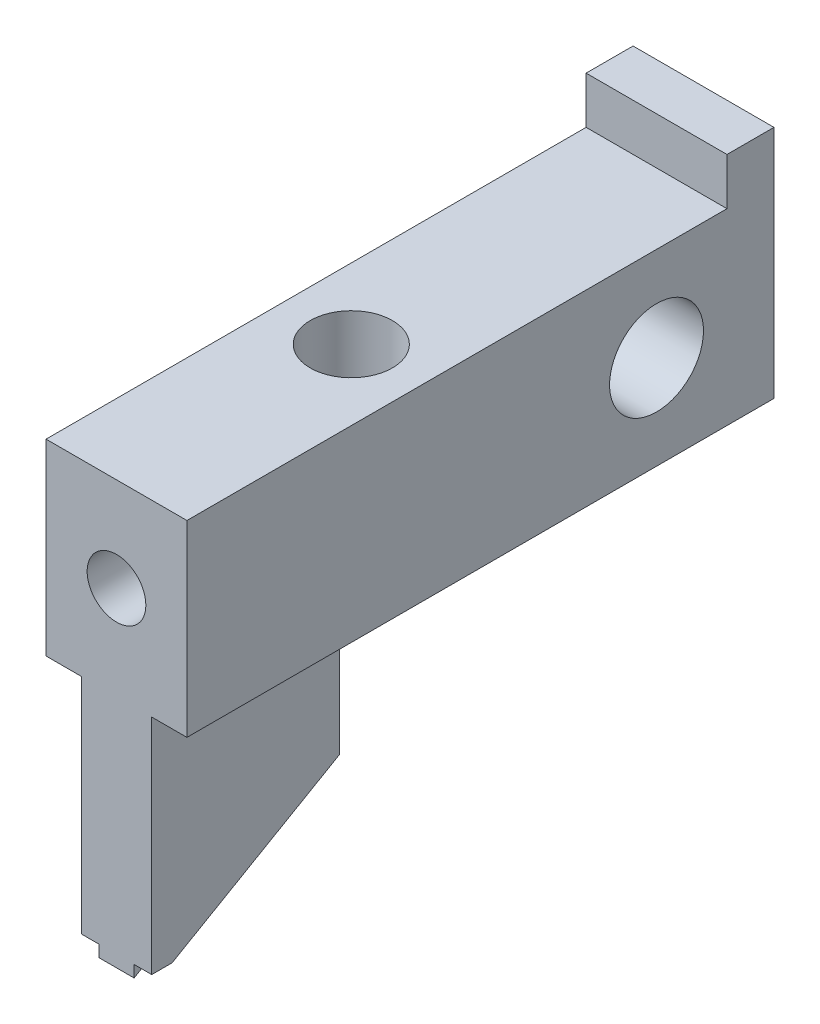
ISO-10303-21;
HEADER;
FILE_DESCRIPTION(('STEP AP214'),'2;1');
FILE_NAME('part.step','',(''),(''),'','','');
FILE_SCHEMA(('AUTOMOTIVE_DESIGN { 1 0 10303 214 1 1 1 1 }'));
ENDSEC;
DATA;
#1=APPLICATION_CONTEXT('core data for automotive mechanical design processes');
#2=APPLICATION_PROTOCOL_DEFINITION('international standard','automotive_design',2000,#1);
#3=PRODUCT_CONTEXT('',#1,'mechanical');
#4=PRODUCT('Part','Part','',(#3));
#5=PRODUCT_RELATED_PRODUCT_CATEGORY('part','',(#4));
#6=PRODUCT_DEFINITION_FORMATION('','',#4);
#7=PRODUCT_DEFINITION_CONTEXT('part definition',#1,'design');
#8=PRODUCT_DEFINITION('design','',#6,#7);
#9=PRODUCT_DEFINITION_SHAPE('','',#8);
#10=(LENGTH_UNIT() NAMED_UNIT(*) SI_UNIT(.MILLI.,.METRE.));
#11=(NAMED_UNIT(*) PLANE_ANGLE_UNIT() SI_UNIT($,.RADIAN.));
#12=(NAMED_UNIT(*) SI_UNIT($,.STERADIAN.) SOLID_ANGLE_UNIT());
#13=UNCERTAINTY_MEASURE_WITH_UNIT(LENGTH_MEASURE(1.E-05),#10,'distance_accuracy_value','');
#14=(GEOMETRIC_REPRESENTATION_CONTEXT(3) GLOBAL_UNCERTAINTY_ASSIGNED_CONTEXT((#13)) GLOBAL_UNIT_ASSIGNED_CONTEXT((#10,
#11,#12)) REPRESENTATION_CONTEXT('',''));
#15=CARTESIAN_POINT('',(0.,0.,0.));
#16=DIRECTION('',(0.,0.,1.));
#17=DIRECTION('',(1.,0.,0.));
#18=AXIS2_PLACEMENT_3D('',#15,#16,#17);
#19=CARTESIAN_POINT('',(3.,13.9999999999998,10.));
#20=DIRECTION('',(0.,0.,1.));
#21=DIRECTION('',(1.,0.,0.));
#22=AXIS2_PLACEMENT_3D('',#19,#20,#21);
#23=CYLINDRICAL_SURFACE('',#22,1.25);
#24=CARTESIAN_POINT('',(3.,13.9999999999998,25.));
#25=DIRECTION('',(0.,0.,1.));
#26=DIRECTION('',(1.,0.,0.));
#27=AXIS2_PLACEMENT_3D('',#24,#25,#26);
#28=CIRCLE('',#27,1.25);
#29=CARTESIAN_POINT('',(4.25,13.9999999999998,25.));
#30=VERTEX_POINT('',#29);
#31=EDGE_CURVE('E224',#30,#30,#28,.T.);
#32=ORIENTED_EDGE('',*,*,#31,.T.);
#33=EDGE_LOOP('',(#32));
#34=FACE_BOUND('',#33,.T.);
#35=CARTESIAN_POINT('',(3.,13.9999999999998,10.));
#36=DIRECTION('',(0.,0.,1.));
#37=DIRECTION('',(1.,0.,0.));
#38=AXIS2_PLACEMENT_3D('',#35,#36,#37);
#39=CIRCLE('',#38,1.25);
#40=CARTESIAN_POINT('',(4.25,13.9999999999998,10.));
#41=VERTEX_POINT('',#40);
#42=EDGE_CURVE('E226',#41,#41,#39,.T.);
#43=ORIENTED_EDGE('',*,*,#42,.F.);
#44=EDGE_LOOP('',(#43));
#45=FACE_BOUND('',#44,.T.);
#46=DIRECTION('',(0.,0.,1.));
#47=VECTOR('',#46,1.);
#48=CARTESIAN_POINT('',(2.25000000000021,14.9999999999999,10.));
#49=LINE('',#48,#47);
#50=CARTESIAN_POINT('',(2.25000000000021,15.,16.5811388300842));
#51=VERTEX_POINT('',#50);
#52=CARTESIAN_POINT('',(2.25000000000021,15.,13.4188611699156));
#53=VERTEX_POINT('',#52);
#54=EDGE_CURVE('E12',#51,#53,#49,.F.);
#55=ORIENTED_EDGE('',*,*,#54,.F.);
#56=CARTESIAN_POINT('',(2.25000000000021,15.,16.5811388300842));
#57=CARTESIAN_POINT('',(2.27458751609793,15.0184370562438,16.5928015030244));
#58=CARTESIAN_POINT('',(2.2999476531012,15.0360429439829,16.6041276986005));
#59=CARTESIAN_POINT('',(2.35218702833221,15.0694876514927,16.6259278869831));
#60=CARTESIAN_POINT('',(2.37906750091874,15.0853250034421,16.6364011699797));
#61=CARTESIAN_POINT('',(2.46216004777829,15.1301302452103,16.6663423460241));
#62=CARTESIAN_POINT('',(2.52057931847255,15.1562065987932,16.6842124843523));
#63=CARTESIAN_POINT('',(2.64238697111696,15.1995044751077,16.7142246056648));
#64=CARTESIAN_POINT('',(2.70579949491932,15.2166794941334,16.7263364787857));
#65=CARTESIAN_POINT('',(2.83530489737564,15.2408426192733,16.7434495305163));
#66=CARTESIAN_POINT('',(2.90138833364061,15.2478638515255,16.7484738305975));
#67=CARTESIAN_POINT('',(3.02725421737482,15.2511262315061,16.750804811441));
#68=CARTESIAN_POINT('',(3.08699982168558,15.2483833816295,16.748838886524));
#69=CARTESIAN_POINT('',(3.20504663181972,15.234499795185,16.7389553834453));
#70=CARTESIAN_POINT('',(3.26334653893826,15.2233517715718,16.7310326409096));
#71=CARTESIAN_POINT('',(3.37540624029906,15.193670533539,16.7101875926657));
#72=CARTESIAN_POINT('',(3.42924397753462,15.1753332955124,16.6973982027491));
#73=CARTESIAN_POINT('',(3.53297352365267,15.1320759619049,16.667737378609));
#74=CARTESIAN_POINT('',(3.58286642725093,15.1071577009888,16.6508670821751));
#75=CARTESIAN_POINT('',(3.6512924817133,15.0671939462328,16.6244445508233));
#76=CARTESIAN_POINT('',(3.67170004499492,15.0544639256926,16.6161038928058));
#77=CARTESIAN_POINT('',(3.71155682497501,15.0279866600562,16.5989544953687));
#78=CARTESIAN_POINT('',(3.73100832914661,15.0142420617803,16.5901469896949));
#79=CARTESIAN_POINT('',(3.74999999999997,15.0000000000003,16.5811388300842));
#80=B_SPLINE_CURVE_WITH_KNOTS('',3,(#56,#57,#58,#59,#60,#61,#62,#63,#64,#65,#66,#67,#68,#69,#70,
#71,#72,#73,#74,#75,#76,#77,#78,#79),.UNSPECIFIED.,.F.,.F.,(4,2,2,2,2,2,2,2,2,2,2,4),(0.,
0.09857084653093,0.197222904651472,0.395501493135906,0.594805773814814,0.793458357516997,
0.972071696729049,1.15084006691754,1.32504074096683,1.49919290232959,1.57553221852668,
1.6516789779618),.UNSPECIFIED.);
#81=CARTESIAN_POINT('',(3.74999999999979,15.,16.5811388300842));
#82=VERTEX_POINT('',#81);
#83=EDGE_CURVE('E152',#51,#82,#80,.T.);
#84=ORIENTED_EDGE('',*,*,#83,.T.);
#85=DIRECTION('',(0.,0.,1.));
#86=VECTOR('',#85,1.);
#87=CARTESIAN_POINT('',(3.74999999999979,14.9999999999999,10.));
#88=LINE('',#87,#86);
#89=CARTESIAN_POINT('',(3.74999999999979,15.,13.4188611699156));
#90=VERTEX_POINT('',#89);
#91=EDGE_CURVE('E41',#90,#82,#88,.T.);
#92=ORIENTED_EDGE('',*,*,#91,.F.);
#93=CARTESIAN_POINT('',(3.74999999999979,15.,13.4188611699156));
#94=CARTESIAN_POINT('',(3.72541248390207,15.0184370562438,13.4071984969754));
#95=CARTESIAN_POINT('',(3.7000523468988,15.0360429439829,13.3958723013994));
#96=CARTESIAN_POINT('',(3.64781297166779,15.0694876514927,13.3740721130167));
#97=CARTESIAN_POINT('',(3.62093249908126,15.0853250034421,13.3635988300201));
#98=CARTESIAN_POINT('',(3.53783995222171,15.1301302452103,13.3336576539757));
#99=CARTESIAN_POINT('',(3.47942068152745,15.1562065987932,13.3157875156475));
#100=CARTESIAN_POINT('',(3.35761302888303,15.1995044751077,13.285775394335));
#101=CARTESIAN_POINT('',(3.29420050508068,15.2166794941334,13.2736635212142));
#102=CARTESIAN_POINT('',(3.16469510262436,15.2408426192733,13.2565504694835));
#103=CARTESIAN_POINT('',(3.09861166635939,15.2478638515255,13.2515261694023));
#104=CARTESIAN_POINT('',(2.97274578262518,15.2511262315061,13.2491951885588));
#105=CARTESIAN_POINT('',(2.91300017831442,15.2483833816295,13.2511611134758));
#106=CARTESIAN_POINT('',(2.79495336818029,15.234499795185,13.2610446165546));
#107=CARTESIAN_POINT('',(2.73665346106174,15.2233517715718,13.2689673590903));
#108=CARTESIAN_POINT('',(2.62459375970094,15.193670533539,13.2898124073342));
#109=CARTESIAN_POINT('',(2.57075602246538,15.1753332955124,13.3026017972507));
#110=CARTESIAN_POINT('',(2.46702647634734,15.1320759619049,13.3322626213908));
#111=CARTESIAN_POINT('',(2.41713357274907,15.1071577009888,13.3491329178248));
#112=CARTESIAN_POINT('',(2.34870751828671,15.0671939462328,13.3755554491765));
#113=CARTESIAN_POINT('',(2.32829995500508,15.0544639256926,13.383896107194));
#114=CARTESIAN_POINT('',(2.28844317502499,15.0279866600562,13.4010455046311));
#115=CARTESIAN_POINT('',(2.26899167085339,15.0142420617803,13.4098530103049));
#116=CARTESIAN_POINT('',(2.25000000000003,15.0000000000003,13.4188611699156));
#117=B_SPLINE_CURVE_WITH_KNOTS('',3,(#93,#94,#95,#96,#97,#98,#99,#100,#101,#102,#103,#104,#105,
#106,#107,#108,#109,#110,#111,#112,#113,#114,#115,#116),.UNSPECIFIED.,.F.,.F.,(4,2,2,2,2,2,2,2,
2,2,2,4),(0.,0.098570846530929,0.197222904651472,0.395501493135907,0.594805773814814,
0.793458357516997,0.972071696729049,1.15084006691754,1.32504074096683,1.49919290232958,
1.57553221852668,1.6516789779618),.UNSPECIFIED.);
#118=EDGE_CURVE('E154',#90,#53,#117,.T.);
#119=ORIENTED_EDGE('',*,*,#118,.T.);
#120=EDGE_LOOP('',(#55,#84,#92,#119));
#121=FACE_BOUND('',#120,.T.);
#122=ADVANCED_FACE('F33',(#34,#45,#121),#23,.F.);
#123=CARTESIAN_POINT('',(0.,9.99999999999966,25.));
#124=DIRECTION('',(1.,0.,0.));
#125=DIRECTION('',(0.,0.,-1.));
#126=AXIS2_PLACEMENT_3D('',#123,#124,#125);
#127=PLANE('',#126);
#128=CARTESIAN_POINT('',(0.,14.,5.));
#129=DIRECTION('',(1.,0.,0.));
#130=DIRECTION('',(0.,0.,-1.));
#131=AXIS2_PLACEMENT_3D('',#128,#129,#130);
#132=CIRCLE('',#131,2.);
#133=CARTESIAN_POINT('',(0.,14.,3.));
#134=VERTEX_POINT('',#133);
#135=EDGE_CURVE('E232',#134,#134,#132,.T.);
#136=ORIENTED_EDGE('',*,*,#135,.T.);
#137=EDGE_LOOP('',(#136));
#138=FACE_BOUND('',#137,.T.);
#139=DIRECTION('',(0.,0.,1.));
#140=VECTOR('',#139,1.);
#141=CARTESIAN_POINT('',(0.,18.,25.));
#142=LINE('',#141,#140);
#143=CARTESIAN_POINT('',(0.,17.9999999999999,2.));
#144=VERTEX_POINT('',#143);
#145=CARTESIAN_POINT('',(0.,18.,25.));
#146=VERTEX_POINT('',#145);
#147=EDGE_CURVE('E55',#144,#146,#142,.T.);
#148=ORIENTED_EDGE('',*,*,#147,.F.);
#149=DIRECTION('',(0.,-1.,0.));
#150=VECTOR('',#149,1.);
#151=CARTESIAN_POINT('',(0.,9.99999999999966,2.));
#152=LINE('',#151,#150);
#153=CARTESIAN_POINT('',(0.,19.9999999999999,2.));
#154=VERTEX_POINT('',#153);
#155=EDGE_CURVE('E307',#154,#144,#152,.T.);
#156=ORIENTED_EDGE('',*,*,#155,.F.);
#157=DIRECTION('',(0.,0.,-1.));
#158=VECTOR('',#157,1.);
#159=CARTESIAN_POINT('',(0.,19.9999999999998,25.));
#160=LINE('',#159,#158);
#161=CARTESIAN_POINT('',(0.,19.9999999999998,0.));
#162=VERTEX_POINT('',#161);
#163=EDGE_CURVE('E262',#154,#162,#160,.T.);
#164=ORIENTED_EDGE('',*,*,#163,.T.);
#165=DIRECTION('',(0.,-1.,0.));
#166=VECTOR('',#165,1.);
#167=CARTESIAN_POINT('',(0.,9.99999999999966,0.));
#168=LINE('',#167,#166);
#169=CARTESIAN_POINT('',(0.,9.99999999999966,0.));
#170=VERTEX_POINT('',#169);
#171=EDGE_CURVE('E227',#162,#170,#168,.T.);
#172=ORIENTED_EDGE('',*,*,#171,.T.);
#173=DIRECTION('',(0.,0.,-1.));
#174=VECTOR('',#173,1.);
#175=CARTESIAN_POINT('',(0.,9.99999999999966,25.));
#176=LINE('',#175,#174);
#177=CARTESIAN_POINT('',(0.,9.99999999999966,25.));
#178=VERTEX_POINT('',#177);
#179=EDGE_CURVE('E148',#178,#170,#176,.T.);
#180=ORIENTED_EDGE('',*,*,#179,.F.);
#181=DIRECTION('',(0.,-1.,0.));
#182=VECTOR('',#181,1.);
#183=CARTESIAN_POINT('',(0.,9.99999999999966,25.));
#184=LINE('',#183,#182);
#185=EDGE_CURVE('E237',#146,#178,#184,.T.);
#186=ORIENTED_EDGE('',*,*,#185,.F.);
#187=EDGE_LOOP('',(#148,#156,#164,#172,#180,#186));
#188=FACE_BOUND('',#187,.T.);
#189=ADVANCED_FACE('F35',(#138,#188),#127,.F.);
#190=CARTESIAN_POINT('',(1.5,0.499999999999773,25.));
#191=DIRECTION('',(1.,0.,0.));
#192=DIRECTION('',(0.,0.,-1.));
#193=AXIS2_PLACEMENT_3D('',#190,#191,#192);
#194=PLANE('',#193);
#195=DIRECTION('',(0.,0.499999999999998,-0.86602540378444));
#196=VECTOR('',#195,1.);
#197=CARTESIAN_POINT('',(1.5,0.124999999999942,24.783493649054));
#198=LINE('',#197,#196);
#199=CARTESIAN_POINT('',(1.5,0.499999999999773,24.1339745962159));
#200=VERTEX_POINT('',#199);
#201=CARTESIAN_POINT('',(1.5,4.61880215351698,17.));
#202=VERTEX_POINT('',#201);
#203=EDGE_CURVE('E337',#200,#202,#198,.T.);
#204=ORIENTED_EDGE('',*,*,#203,.F.);
#205=DIRECTION('',(0.,0.,-1.));
#206=VECTOR('',#205,1.);
#207=CARTESIAN_POINT('',(1.5,0.499999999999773,25.));
#208=LINE('',#207,#206);
#209=CARTESIAN_POINT('',(1.5,0.499999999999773,25.));
#210=VERTEX_POINT('',#209);
#211=EDGE_CURVE('E288',#210,#200,#208,.T.);
#212=ORIENTED_EDGE('',*,*,#211,.F.);
#213=DIRECTION('',(0.,-1.,0.));
#214=VECTOR('',#213,1.);
#215=CARTESIAN_POINT('',(1.5,0.499999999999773,25.));
#216=LINE('',#215,#214);
#217=CARTESIAN_POINT('',(1.5,9.99999999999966,25.));
#218=VERTEX_POINT('',#217);
#219=EDGE_CURVE('E242',#218,#210,#216,.T.);
#220=ORIENTED_EDGE('',*,*,#219,.F.);
#221=DIRECTION('',(0.,0.,-1.));
#222=VECTOR('',#221,1.);
#223=CARTESIAN_POINT('',(1.5,9.99999999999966,25.));
#224=LINE('',#223,#222);
#225=CARTESIAN_POINT('',(1.5,9.99999999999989,17.));
#226=VERTEX_POINT('',#225);
#227=EDGE_CURVE('E291',#218,#226,#224,.T.);
#228=ORIENTED_EDGE('',*,*,#227,.T.);
#229=DIRECTION('',(0.,1.,0.));
#230=VECTOR('',#229,1.);
#231=CARTESIAN_POINT('',(1.5,0.499999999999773,17.));
#232=LINE('',#231,#230);
#233=EDGE_CURVE('E333',#202,#226,#232,.T.);
#234=ORIENTED_EDGE('',*,*,#233,.F.);
#235=EDGE_LOOP('',(#204,#212,#220,#228,#234));
#236=FACE_BOUND('',#235,.T.);
#237=ADVANCED_FACE('F219',(#236),#194,.F.);
#238=CARTESIAN_POINT('',(1.5,0.499999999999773,25.));
#239=DIRECTION('',(0.,1.,0.));
#240=DIRECTION('',(0.,0.,1.));
#241=AXIS2_PLACEMENT_3D('',#238,#239,#240);
#242=PLANE('',#241);
#243=DIRECTION('',(-1.,0.,0.));
#244=VECTOR('',#243,1.);
#245=CARTESIAN_POINT('',(1.5,0.499999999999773,24.1339745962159));
#246=LINE('',#245,#244);
#247=CARTESIAN_POINT('',(2.25,0.499999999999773,24.1339745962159));
#248=VERTEX_POINT('',#247);
#249=EDGE_CURVE('E380',#248,#200,#246,.T.);
#250=ORIENTED_EDGE('',*,*,#249,.F.);
#251=DIRECTION('',(0.,0.,-1.));
#252=VECTOR('',#251,1.);
#253=CARTESIAN_POINT('',(2.25,0.499999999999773,25.));
#254=LINE('',#253,#252);
#255=CARTESIAN_POINT('',(2.25,0.499999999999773,25.));
#256=VERTEX_POINT('',#255);
#257=EDGE_CURVE('E285',#256,#248,#254,.T.);
#258=ORIENTED_EDGE('',*,*,#257,.F.);
#259=DIRECTION('',(1.,0.,0.));
#260=VECTOR('',#259,1.);
#261=CARTESIAN_POINT('',(1.5,0.499999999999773,25.));
#262=LINE('',#261,#260);
#263=EDGE_CURVE('E244',#210,#256,#262,.T.);
#264=ORIENTED_EDGE('',*,*,#263,.F.);
#265=ORIENTED_EDGE('',*,*,#211,.T.);
#266=EDGE_LOOP('',(#250,#258,#264,#265));
#267=FACE_BOUND('',#266,.T.);
#268=ADVANCED_FACE('F367',(#267),#242,.F.);
#269=CARTESIAN_POINT('',(2.25,-2.27373675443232E-13,25.));
#270=DIRECTION('',(1.,0.,0.));
#271=DIRECTION('',(0.,0.,-1.));
#272=AXIS2_PLACEMENT_3D('',#269,#270,#271);
#273=PLANE('',#272);
#274=DIRECTION('',(0.,0.499999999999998,-0.86602540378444));
#275=VECTOR('',#274,1.);
#276=CARTESIAN_POINT('',(2.25,0.,25.0000000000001));
#277=LINE('',#276,#275);
#278=CARTESIAN_POINT('',(2.25,0.,25.));
#279=VERTEX_POINT('',#278);
#280=EDGE_CURVE('E399',#279,#248,#277,.T.);
#281=ORIENTED_EDGE('',*,*,#280,.F.);
#282=DIRECTION('',(0.,-1.,0.));
#283=VECTOR('',#282,1.);
#284=CARTESIAN_POINT('',(2.25,-2.27373675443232E-13,25.));
#285=LINE('',#284,#283);
#286=EDGE_CURVE('E246',#256,#279,#285,.T.);
#287=ORIENTED_EDGE('',*,*,#286,.F.);
#288=ORIENTED_EDGE('',*,*,#257,.T.);
#289=EDGE_LOOP('',(#281,#287,#288));
#290=FACE_BOUND('',#289,.T.);
#291=ADVANCED_FACE('F363',(#290),#273,.F.);
#292=CARTESIAN_POINT('',(3.75,-2.27373675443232E-13,25.));
#293=DIRECTION('',(-1.,0.,0.));
#294=DIRECTION('',(0.,0.,1.));
#295=AXIS2_PLACEMENT_3D('',#292,#293,#294);
#296=PLANE('',#295);
#297=DIRECTION('',(0.,-0.499999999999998,0.86602540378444));
#298=VECTOR('',#297,1.);
#299=CARTESIAN_POINT('',(3.75,0.,25.0000000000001));
#300=LINE('',#299,#298);
#301=CARTESIAN_POINT('',(3.75,0.499999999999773,24.1339745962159));
#302=VERTEX_POINT('',#301);
#303=CARTESIAN_POINT('',(3.75,0.,25.));
#304=VERTEX_POINT('',#303);
#305=EDGE_CURVE('E397',#302,#304,#300,.T.);
#306=ORIENTED_EDGE('',*,*,#305,.F.);
#307=DIRECTION('',(0.,0.,-1.));
#308=VECTOR('',#307,1.);
#309=CARTESIAN_POINT('',(3.75,0.499999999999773,25.));
#310=LINE('',#309,#308);
#311=CARTESIAN_POINT('',(3.75,0.499999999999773,25.));
#312=VERTEX_POINT('',#311);
#313=EDGE_CURVE('E282',#312,#302,#310,.T.);
#314=ORIENTED_EDGE('',*,*,#313,.F.);
#315=DIRECTION('',(0.,1.,0.));
#316=VECTOR('',#315,1.);
#317=CARTESIAN_POINT('',(3.75,-2.27373675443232E-13,25.));
#318=LINE('',#317,#316);
#319=EDGE_CURVE('E252',#304,#312,#318,.T.);
#320=ORIENTED_EDGE('',*,*,#319,.F.);
#321=EDGE_LOOP('',(#306,#314,#320));
#322=FACE_BOUND('',#321,.T.);
#323=ADVANCED_FACE('F359',(#322),#296,.F.);
#324=CARTESIAN_POINT('',(3.75,0.499999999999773,25.));
#325=DIRECTION('',(0.,1.,0.));
#326=DIRECTION('',(0.,0.,1.));
#327=AXIS2_PLACEMENT_3D('',#324,#325,#326);
#328=PLANE('',#327);
#329=DIRECTION('',(-1.,0.,0.));
#330=VECTOR('',#329,1.);
#331=CARTESIAN_POINT('',(3.75,0.499999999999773,24.1339745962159));
#332=LINE('',#331,#330);
#333=CARTESIAN_POINT('',(4.5,0.499999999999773,24.133974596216));
#334=VERTEX_POINT('',#333);
#335=EDGE_CURVE('E395',#334,#302,#332,.T.);
#336=ORIENTED_EDGE('',*,*,#335,.F.);
#337=DIRECTION('',(0.,0.,-1.));
#338=VECTOR('',#337,1.);
#339=CARTESIAN_POINT('',(4.5,0.499999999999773,25.));
#340=LINE('',#339,#338);
#341=CARTESIAN_POINT('',(4.5,0.499999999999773,25.));
#342=VERTEX_POINT('',#341);
#343=EDGE_CURVE('E279',#342,#334,#340,.T.);
#344=ORIENTED_EDGE('',*,*,#343,.F.);
#345=DIRECTION('',(1.,0.,0.));
#346=VECTOR('',#345,1.);
#347=CARTESIAN_POINT('',(3.75,0.499999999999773,25.));
#348=LINE('',#347,#346);
#349=EDGE_CURVE('E254',#312,#342,#348,.T.);
#350=ORIENTED_EDGE('',*,*,#349,.F.);
#351=ORIENTED_EDGE('',*,*,#313,.T.);
#352=EDGE_LOOP('',(#336,#344,#350,#351));
#353=FACE_BOUND('',#352,.T.);
#354=ADVANCED_FACE('F353',(#353),#328,.F.);
#355=CARTESIAN_POINT('',(4.5,0.499999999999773,25.));
#356=DIRECTION('',(-1.,0.,0.));
#357=DIRECTION('',(0.,0.,1.));
#358=AXIS2_PLACEMENT_3D('',#355,#356,#357);
#359=PLANE('',#358);
#360=DIRECTION('',(0.,-0.499999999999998,0.86602540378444));
#361=VECTOR('',#360,1.);
#362=CARTESIAN_POINT('',(4.5,0.124999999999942,24.783493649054));
#363=LINE('',#362,#361);
#364=CARTESIAN_POINT('',(4.5,4.61880215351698,17.));
#365=VERTEX_POINT('',#364);
#366=EDGE_CURVE('E330',#365,#334,#363,.T.);
#367=ORIENTED_EDGE('',*,*,#366,.F.);
#368=DIRECTION('',(0.,-1.,0.));
#369=VECTOR('',#368,1.);
#370=CARTESIAN_POINT('',(4.5,0.499999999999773,17.));
#371=LINE('',#370,#369);
#372=CARTESIAN_POINT('',(4.5,9.99999999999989,17.));
#373=VERTEX_POINT('',#372);
#374=EDGE_CURVE('E329',#373,#365,#371,.T.);
#375=ORIENTED_EDGE('',*,*,#374,.F.);
#376=DIRECTION('',(0.,0.,-1.));
#377=VECTOR('',#376,1.);
#378=CARTESIAN_POINT('',(4.5,9.99999999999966,25.));
#379=LINE('',#378,#377);
#380=CARTESIAN_POINT('',(4.5,9.99999999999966,25.));
#381=VERTEX_POINT('',#380);
#382=EDGE_CURVE('E276',#381,#373,#379,.T.);
#383=ORIENTED_EDGE('',*,*,#382,.F.);
#384=DIRECTION('',(0.,1.,0.));
#385=VECTOR('',#384,1.);
#386=CARTESIAN_POINT('',(4.5,0.499999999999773,25.));
#387=LINE('',#386,#385);
#388=EDGE_CURVE('E256',#342,#381,#387,.T.);
#389=ORIENTED_EDGE('',*,*,#388,.F.);
#390=ORIENTED_EDGE('',*,*,#343,.T.);
#391=EDGE_LOOP('',(#367,#375,#383,#389,#390));
#392=FACE_BOUND('',#391,.T.);
#393=ADVANCED_FACE('F328',(#392),#359,.F.);
#394=CARTESIAN_POINT('',(6.,9.99999999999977,25.));
#395=DIRECTION('',(-1.,0.,0.));
#396=DIRECTION('',(0.,0.,1.));
#397=AXIS2_PLACEMENT_3D('',#394,#395,#396);
#398=PLANE('',#397);
#399=CARTESIAN_POINT('',(6.,14.,5.));
#400=DIRECTION('',(1.,0.,0.));
#401=DIRECTION('',(0.,0.,-1.));
#402=AXIS2_PLACEMENT_3D('',#399,#400,#401);
#403=CIRCLE('',#402,2.);
#404=CARTESIAN_POINT('',(6.,14.,3.));
#405=VERTEX_POINT('',#404);
#406=EDGE_CURVE('E335',#405,#405,#403,.T.);
#407=ORIENTED_EDGE('',*,*,#406,.F.);
#408=EDGE_LOOP('',(#407));
#409=FACE_BOUND('',#408,.T.);
#410=DIRECTION('',(0.,0.,1.));
#411=VECTOR('',#410,1.);
#412=CARTESIAN_POINT('',(6.,18.,25.));
#413=LINE('',#412,#411);
#414=CARTESIAN_POINT('',(6.,17.9999999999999,2.));
#415=VERTEX_POINT('',#414);
#416=CARTESIAN_POINT('',(6.,18.,25.));
#417=VERTEX_POINT('',#416);
#418=EDGE_CURVE('E161',#415,#417,#413,.T.);
#419=ORIENTED_EDGE('',*,*,#418,.T.);
#420=DIRECTION('',(0.,1.,0.));
#421=VECTOR('',#420,1.);
#422=CARTESIAN_POINT('',(6.,9.99999999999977,25.));
#423=LINE('',#422,#421);
#424=CARTESIAN_POINT('',(6.,9.99999999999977,25.));
#425=VERTEX_POINT('',#424);
#426=EDGE_CURVE('E260',#425,#417,#423,.T.);
#427=ORIENTED_EDGE('',*,*,#426,.F.);
#428=DIRECTION('',(0.,0.,-1.));
#429=VECTOR('',#428,1.);
#430=CARTESIAN_POINT('',(6.,9.99999999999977,25.));
#431=LINE('',#430,#429);
#432=CARTESIAN_POINT('',(6.,9.99999999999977,0.));
#433=VERTEX_POINT('',#432);
#434=EDGE_CURVE('E274',#425,#433,#431,.T.);
#435=ORIENTED_EDGE('',*,*,#434,.T.);
#436=DIRECTION('',(0.,1.,0.));
#437=VECTOR('',#436,1.);
#438=CARTESIAN_POINT('',(6.,9.99999999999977,0.));
#439=LINE('',#438,#437);
#440=CARTESIAN_POINT('',(6.,19.9999999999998,0.));
#441=VERTEX_POINT('',#440);
#442=EDGE_CURVE('E266',#433,#441,#439,.T.);
#443=ORIENTED_EDGE('',*,*,#442,.T.);
#444=DIRECTION('',(0.,0.,-1.));
#445=VECTOR('',#444,1.);
#446=CARTESIAN_POINT('',(6.,19.9999999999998,25.));
#447=LINE('',#446,#445);
#448=CARTESIAN_POINT('',(6.,19.9999999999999,2.));
#449=VERTEX_POINT('',#448);
#450=EDGE_CURVE('E272',#449,#441,#447,.T.);
#451=ORIENTED_EDGE('',*,*,#450,.F.);
#452=DIRECTION('',(0.,-1.,0.));
#453=VECTOR('',#452,1.);
#454=CARTESIAN_POINT('',(6.,17.9999999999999,2.));
#455=LINE('',#454,#453);
#456=EDGE_CURVE('E158',#449,#415,#455,.T.);
#457=ORIENTED_EDGE('',*,*,#456,.T.);
#458=EDGE_LOOP('',(#419,#427,#435,#443,#451,#457));
#459=FACE_BOUND('',#458,.T.);
#460=ADVANCED_FACE('F315',(#409,#459),#398,.F.);
#461=CARTESIAN_POINT('',(0.,19.9999999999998,25.));
#462=DIRECTION('',(0.,-1.,0.));
#463=DIRECTION('',(0.,0.,-1.));
#464=AXIS2_PLACEMENT_3D('',#461,#462,#463);
#465=PLANE('',#464);
#466=DIRECTION('',(1.,0.,0.));
#467=VECTOR('',#466,1.);
#468=CARTESIAN_POINT('',(-9.,19.9999999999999,2.));
#469=LINE('',#468,#467);
#470=EDGE_CURVE('E312',#154,#449,#469,.T.);
#471=ORIENTED_EDGE('',*,*,#470,.T.);
#472=ORIENTED_EDGE('',*,*,#450,.T.);
#473=DIRECTION('',(-1.,0.,0.));
#474=VECTOR('',#473,1.);
#475=CARTESIAN_POINT('',(0.,19.9999999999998,0.));
#476=LINE('',#475,#474);
#477=EDGE_CURVE('E240',#441,#162,#476,.T.);
#478=ORIENTED_EDGE('',*,*,#477,.T.);
#479=ORIENTED_EDGE('',*,*,#163,.F.);
#480=EDGE_LOOP('',(#471,#472,#478,#479));
#481=FACE_BOUND('',#480,.T.);
#482=ADVANCED_FACE('F310',(#481),#465,.F.);
#483=CARTESIAN_POINT('',(0.,19.9999999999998,25.));
#484=DIRECTION('',(0.,0.,-1.));
#485=DIRECTION('',(-1.,0.,0.));
#486=AXIS2_PLACEMENT_3D('',#483,#484,#485);
#487=PLANE('',#486);
#488=ORIENTED_EDGE('',*,*,#31,.F.);
#489=EDGE_LOOP('',(#488));
#490=FACE_BOUND('',#489,.T.);
#491=DIRECTION('',(1.,0.,0.));
#492=VECTOR('',#491,1.);
#493=CARTESIAN_POINT('',(-9.,18.,25.));
#494=LINE('',#493,#492);
#495=EDGE_CURVE('E393',#146,#417,#494,.T.);
#496=ORIENTED_EDGE('',*,*,#495,.F.);
#497=ORIENTED_EDGE('',*,*,#185,.T.);
#498=DIRECTION('',(1.,0.,0.));
#499=VECTOR('',#498,1.);
#500=CARTESIAN_POINT('',(0.,9.99999999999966,25.));
#501=LINE('',#500,#499);
#502=EDGE_CURVE('E239',#178,#218,#501,.T.);
#503=ORIENTED_EDGE('',*,*,#502,.T.);
#504=ORIENTED_EDGE('',*,*,#219,.T.);
#505=ORIENTED_EDGE('',*,*,#263,.T.);
#506=ORIENTED_EDGE('',*,*,#286,.T.);
#507=DIRECTION('',(1.,0.,0.));
#508=VECTOR('',#507,1.);
#509=CARTESIAN_POINT('',(2.25,-2.27373675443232E-13,25.));
#510=LINE('',#509,#508);
#511=EDGE_CURVE('E249',#279,#304,#510,.T.);
#512=ORIENTED_EDGE('',*,*,#511,.T.);
#513=ORIENTED_EDGE('',*,*,#319,.T.);
#514=ORIENTED_EDGE('',*,*,#349,.T.);
#515=ORIENTED_EDGE('',*,*,#388,.T.);
#516=DIRECTION('',(1.,0.,0.));
#517=VECTOR('',#516,1.);
#518=CARTESIAN_POINT('',(4.5,9.99999999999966,25.));
#519=LINE('',#518,#517);
#520=EDGE_CURVE('E258',#381,#425,#519,.T.);
#521=ORIENTED_EDGE('',*,*,#520,.T.);
#522=ORIENTED_EDGE('',*,*,#426,.T.);
#523=EDGE_LOOP('',(#496,#497,#503,#504,#505,#506,#512,#513,#514,#515,#521,#522));
#524=FACE_BOUND('',#523,.T.);
#525=ADVANCED_FACE('F321',(#490,#524),#487,.F.);
#526=CARTESIAN_POINT('',(0.,19.9999999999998,0.));
#527=DIRECTION('',(0.,0.,-1.));
#528=DIRECTION('',(-1.,0.,0.));
#529=AXIS2_PLACEMENT_3D('',#526,#527,#528);
#530=PLANE('',#529);
#531=DIRECTION('',(1.,0.,0.));
#532=VECTOR('',#531,1.);
#533=CARTESIAN_POINT('',(4.5,9.99999999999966,0.));
#534=LINE('',#533,#532);
#535=EDGE_CURVE('E230',#170,#433,#534,.T.);
#536=ORIENTED_EDGE('',*,*,#535,.F.);
#537=ORIENTED_EDGE('',*,*,#171,.F.);
#538=ORIENTED_EDGE('',*,*,#477,.F.);
#539=ORIENTED_EDGE('',*,*,#442,.F.);
#540=EDGE_LOOP('',(#536,#537,#538,#539));
#541=FACE_BOUND('',#540,.T.);
#542=ADVANCED_FACE('F210',(#541),#530,.T.);
#543=CARTESIAN_POINT('',(4.5,9.99999999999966,25.));
#544=DIRECTION('',(0.,1.,0.));
#545=DIRECTION('',(-1.,0.,0.));
#546=AXIS2_PLACEMENT_3D('',#543,#544,#545);
#547=PLANE('',#546);
#548=ORIENTED_EDGE('',*,*,#535,.T.);
#549=ORIENTED_EDGE('',*,*,#434,.F.);
#550=ORIENTED_EDGE('',*,*,#520,.F.);
#551=ORIENTED_EDGE('',*,*,#382,.T.);
#552=DIRECTION('',(1.,0.,0.));
#553=VECTOR('',#552,1.);
#554=CARTESIAN_POINT('',(-9.,9.99999999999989,17.));
#555=LINE('',#554,#553);
#556=EDGE_CURVE('E384',#226,#373,#555,.T.);
#557=ORIENTED_EDGE('',*,*,#556,.F.);
#558=ORIENTED_EDGE('',*,*,#227,.F.);
#559=ORIENTED_EDGE('',*,*,#502,.F.);
#560=ORIENTED_EDGE('',*,*,#179,.T.);
#561=EDGE_LOOP('',(#548,#549,#550,#551,#557,#558,#559,#560));
#562=FACE_BOUND('',#561,.T.);
#563=ADVANCED_FACE('F205',(#562),#547,.F.);
#564=CARTESIAN_POINT('',(3.,13.9999999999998,10.));
#565=DIRECTION('',(0.,0.,1.));
#566=DIRECTION('',(1.,0.,0.));
#567=AXIS2_PLACEMENT_3D('',#564,#565,#566);
#568=PLANE('',#567);
#569=ORIENTED_EDGE('',*,*,#42,.T.);
#570=EDGE_LOOP('',(#569));
#571=FACE_BOUND('',#570,.T.);
#572=ADVANCED_FACE('F202',(#571),#568,.T.);
#573=CARTESIAN_POINT('',(-9.,14.,5.));
#574=DIRECTION('',(1.,0.,0.));
#575=DIRECTION('',(0.,0.,-1.));
#576=AXIS2_PLACEMENT_3D('',#573,#574,#575);
#577=CYLINDRICAL_SURFACE('',#576,2.);
#578=ORIENTED_EDGE('',*,*,#406,.T.);
#579=EDGE_LOOP('',(#578));
#580=FACE_BOUND('',#579,.T.);
#581=ORIENTED_EDGE('',*,*,#135,.F.);
#582=EDGE_LOOP('',(#581));
#583=FACE_BOUND('',#582,.T.);
#584=ADVANCED_FACE('F199',(#580,#583),#577,.F.);
#585=CARTESIAN_POINT('',(-9.,0.,25.));
#586=DIRECTION('',(0.,-0.86602540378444,-0.499999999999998));
#587=DIRECTION('',(0.,0.499999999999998,-0.86602540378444));
#588=AXIS2_PLACEMENT_3D('',#585,#586,#587);
#589=PLANE('',#588);
#590=ORIENTED_EDGE('',*,*,#203,.T.);
#591=DIRECTION('',(1.,0.,0.));
#592=VECTOR('',#591,1.);
#593=CARTESIAN_POINT('',(-9.,4.61880215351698,17.));
#594=LINE('',#593,#592);
#595=EDGE_CURVE('E385',#202,#365,#594,.T.);
#596=ORIENTED_EDGE('',*,*,#595,.T.);
#597=ORIENTED_EDGE('',*,*,#366,.T.);
#598=ORIENTED_EDGE('',*,*,#335,.T.);
#599=ORIENTED_EDGE('',*,*,#305,.T.);
#600=ORIENTED_EDGE('',*,*,#511,.F.);
#601=ORIENTED_EDGE('',*,*,#280,.T.);
#602=ORIENTED_EDGE('',*,*,#249,.T.);
#603=EDGE_LOOP('',(#590,#596,#597,#598,#599,#600,#601,#602));
#604=FACE_BOUND('',#603,.T.);
#605=ADVANCED_FACE('F195',(#604),#589,.T.);
#606=CARTESIAN_POINT('',(-9.,4.61880215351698,17.));
#607=DIRECTION('',(0.,0.,-1.));
#608=DIRECTION('',(-1.,0.,0.));
#609=AXIS2_PLACEMENT_3D('',#606,#607,#608);
#610=PLANE('',#609);
#611=ORIENTED_EDGE('',*,*,#233,.T.);
#612=ORIENTED_EDGE('',*,*,#556,.T.);
#613=ORIENTED_EDGE('',*,*,#374,.T.);
#614=ORIENTED_EDGE('',*,*,#595,.F.);
#615=EDGE_LOOP('',(#611,#612,#613,#614));
#616=FACE_BOUND('',#615,.T.);
#617=ADVANCED_FACE('F191',(#616),#610,.T.);
#618=CARTESIAN_POINT('',(-9.,17.9999999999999,2.));
#619=DIRECTION('',(0.,0.,1.));
#620=DIRECTION('',(1.,0.,0.));
#621=AXIS2_PLACEMENT_3D('',#618,#619,#620);
#622=PLANE('',#621);
#623=ORIENTED_EDGE('',*,*,#155,.T.);
#624=DIRECTION('',(1.,0.,0.));
#625=VECTOR('',#624,1.);
#626=CARTESIAN_POINT('',(-9.,17.9999999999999,2.));
#627=LINE('',#626,#625);
#628=EDGE_CURVE('E387',#144,#415,#627,.T.);
#629=ORIENTED_EDGE('',*,*,#628,.T.);
#630=ORIENTED_EDGE('',*,*,#456,.F.);
#631=ORIENTED_EDGE('',*,*,#470,.F.);
#632=EDGE_LOOP('',(#623,#629,#630,#631));
#633=FACE_BOUND('',#632,.T.);
#634=ADVANCED_FACE('F187',(#633),#622,.T.);
#635=CARTESIAN_POINT('',(-9.,18.,25.));
#636=DIRECTION('',(0.,1.,0.));
#637=DIRECTION('',(0.,0.,1.));
#638=AXIS2_PLACEMENT_3D('',#635,#636,#637);
#639=PLANE('',#638);
#640=CARTESIAN_POINT('',(3.,18.,14.9999999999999));
#641=DIRECTION('',(0.,1.,0.));
#642=DIRECTION('',(0.,0.,1.));
#643=AXIS2_PLACEMENT_3D('',#640,#641,#642);
#644=CIRCLE('',#643,1.75);
#645=CARTESIAN_POINT('',(3.,18.,16.7499999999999));
#646=VERTEX_POINT('',#645);
#647=EDGE_CURVE('E522',#646,#646,#644,.T.);
#648=ORIENTED_EDGE('',*,*,#647,.F.);
#649=EDGE_LOOP('',(#648));
#650=FACE_BOUND('',#649,.T.);
#651=ORIENTED_EDGE('',*,*,#147,.T.);
#652=ORIENTED_EDGE('',*,*,#495,.T.);
#653=ORIENTED_EDGE('',*,*,#418,.F.);
#654=ORIENTED_EDGE('',*,*,#628,.F.);
#655=EDGE_LOOP('',(#651,#652,#653,#654));
#656=FACE_BOUND('',#655,.T.);
#657=ADVANCED_FACE('F183',(#650,#656),#639,.T.);
#658=CARTESIAN_POINT('',(3.,15.,14.9999999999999));
#659=DIRECTION('',(0.,1.,0.));
#660=DIRECTION('',(0.,0.,1.));
#661=AXIS2_PLACEMENT_3D('',#658,#659,#660);
#662=PLANE('',#661);
#663=ORIENTED_EDGE('',*,*,#54,.T.);
#664=CARTESIAN_POINT('',(3.,15.,14.9999999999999));
#665=DIRECTION('',(0.,1.,0.));
#666=DIRECTION('',(0.,0.,1.));
#667=AXIS2_PLACEMENT_3D('',#664,#665,#666);
#668=CIRCLE('',#667,1.75);
#669=EDGE_CURVE('E155',#53,#51,#668,.T.);
#670=ORIENTED_EDGE('',*,*,#669,.T.);
#671=EDGE_LOOP('',(#663,#670));
#672=FACE_BOUND('',#671,.T.);
#673=ADVANCED_FACE('F182',(#672),#662,.T.);
#674=ORIENTED_EDGE('',*,*,#91,.T.);
#675=EDGE_CURVE('E47',#82,#90,#668,.T.);
#676=ORIENTED_EDGE('',*,*,#675,.T.);
#677=EDGE_LOOP('',(#674,#676));
#678=FACE_BOUND('',#677,.T.);
#679=ADVANCED_FACE('F144',(#678),#662,.T.);
#680=CARTESIAN_POINT('',(3.,15.,14.9999999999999));
#681=DIRECTION('',(0.,1.,0.));
#682=DIRECTION('',(0.,0.,1.));
#683=AXIS2_PLACEMENT_3D('',#680,#681,#682);
#684=CYLINDRICAL_SURFACE('',#683,1.75);
#685=ORIENTED_EDGE('',*,*,#647,.T.);
#686=EDGE_LOOP('',(#685));
#687=FACE_BOUND('',#686,.T.);
#688=ORIENTED_EDGE('',*,*,#669,.F.);
#689=ORIENTED_EDGE('',*,*,#118,.F.);
#690=ORIENTED_EDGE('',*,*,#675,.F.);
#691=ORIENTED_EDGE('',*,*,#83,.F.);
#692=EDGE_LOOP('',(#688,#689,#690,#691));
#693=FACE_BOUND('',#692,.T.);
#694=ADVANCED_FACE('F151',(#687,#693),#684,.F.);
#695=CLOSED_SHELL('',(#122,#189,#237,#268,#291,#323,#354,#393,#460,#482,#525,#542,#563,#572,
#584,#605,#617,#634,#657,#673,#679,#694));
#696=MANIFOLD_SOLID_BREP('B2',#695);
#697=ADVANCED_BREP_SHAPE_REPRESENTATION('',(#18,#696),#14);
#698=SHAPE_DEFINITION_REPRESENTATION(#9,#697);
ENDSEC;
END-ISO-10303-21;
